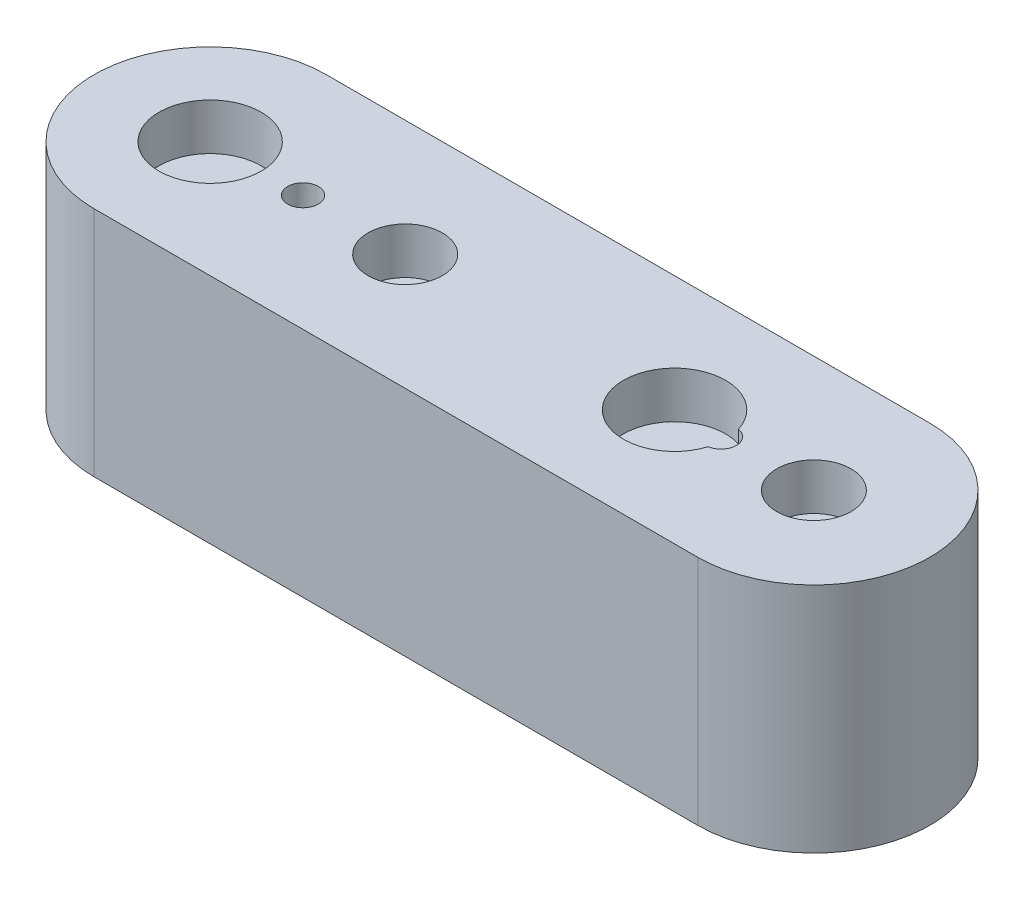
ISO-10303-21;
HEADER;
FILE_DESCRIPTION(('STEP AP214'),'2;1');
FILE_NAME('part.step','',(''),(''),'','','');
FILE_SCHEMA(('AUTOMOTIVE_DESIGN { 1 0 10303 214 1 1 1 1 }'));
ENDSEC;
DATA;
#1=APPLICATION_CONTEXT('core data for automotive mechanical design processes');
#2=APPLICATION_PROTOCOL_DEFINITION('international standard','automotive_design',2000,#1);
#3=PRODUCT_CONTEXT('',#1,'mechanical');
#4=PRODUCT('Part','Part','',(#3));
#5=PRODUCT_RELATED_PRODUCT_CATEGORY('part','',(#4));
#6=PRODUCT_DEFINITION_FORMATION('','',#4);
#7=PRODUCT_DEFINITION_CONTEXT('part definition',#1,'design');
#8=PRODUCT_DEFINITION('design','',#6,#7);
#9=PRODUCT_DEFINITION_SHAPE('','',#8);
#10=(LENGTH_UNIT() NAMED_UNIT(*) SI_UNIT(.MILLI.,.METRE.));
#11=(NAMED_UNIT(*) PLANE_ANGLE_UNIT() SI_UNIT($,.RADIAN.));
#12=(NAMED_UNIT(*) SI_UNIT($,.STERADIAN.) SOLID_ANGLE_UNIT());
#13=UNCERTAINTY_MEASURE_WITH_UNIT(LENGTH_MEASURE(1.E-05),#10,'distance_accuracy_value','');
#14=(GEOMETRIC_REPRESENTATION_CONTEXT(3) GLOBAL_UNCERTAINTY_ASSIGNED_CONTEXT((#13)) GLOBAL_UNIT_ASSIGNED_CONTEXT((#10,
#11,#12)) REPRESENTATION_CONTEXT('',''));
#15=CARTESIAN_POINT('',(0.,0.,0.));
#16=DIRECTION('',(0.,0.,1.));
#17=DIRECTION('',(1.,0.,0.));
#18=AXIS2_PLACEMENT_3D('',#15,#16,#17);
#19=CARTESIAN_POINT('',(-32.5,20.,0.));
#20=DIRECTION('',(0.,1.,0.));
#21=DIRECTION('',(1.,0.,0.));
#22=AXIS2_PLACEMENT_3D('',#19,#20,#21);
#23=PLANE('',#22);
#24=CARTESIAN_POINT('',(-32.5,20.,0.));
#25=DIRECTION('',(0.,1.,0.));
#26=DIRECTION('',(0.,0.,1.));
#27=AXIS2_PLACEMENT_3D('',#24,#25,#26);
#28=CIRCLE('',#27,5.5);
#29=CARTESIAN_POINT('',(-32.5,20.,5.5));
#30=VERTEX_POINT('',#29);
#31=EDGE_CURVE('E593',#30,#30,#28,.T.);
#32=ORIENTED_EDGE('',*,*,#31,.T.);
#33=EDGE_LOOP('',(#32));
#34=FACE_BOUND('',#33,.T.);
#35=ADVANCED_FACE('F17',(#34),#23,.T.);
#36=CARTESIAN_POINT('',(-11.5,20.,0.));
#37=DIRECTION('',(0.,1.,0.));
#38=DIRECTION('',(1.,0.,0.));
#39=AXIS2_PLACEMENT_3D('',#36,#37,#38);
#40=PLANE('',#39);
#41=CARTESIAN_POINT('',(-11.5,20.,0.));
#42=DIRECTION('',(0.,1.,0.));
#43=DIRECTION('',(0.,0.,1.));
#44=AXIS2_PLACEMENT_3D('',#41,#42,#43);
#45=CIRCLE('',#44,4.);
#46=CARTESIAN_POINT('',(-11.5,20.,4.));
#47=VERTEX_POINT('',#46);
#48=EDGE_CURVE('E552',#47,#47,#45,.T.);
#49=ORIENTED_EDGE('',*,*,#48,.T.);
#50=EDGE_LOOP('',(#49));
#51=FACE_BOUND('',#50,.T.);
#52=ADVANCED_FACE('F379',(#51),#40,.T.);
#53=CARTESIAN_POINT('',(32.5,20.,0.));
#54=DIRECTION('',(0.,1.,0.));
#55=DIRECTION('',(1.,0.,0.));
#56=AXIS2_PLACEMENT_3D('',#53,#54,#55);
#57=PLANE('',#56);
#58=CARTESIAN_POINT('',(32.5,20.,0.));
#59=DIRECTION('',(0.,1.,0.));
#60=DIRECTION('',(0.,0.,1.));
#61=AXIS2_PLACEMENT_3D('',#58,#59,#60);
#62=CIRCLE('',#61,4.);
#63=CARTESIAN_POINT('',(32.5,20.,3.99999999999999));
#64=VERTEX_POINT('',#63);
#65=EDGE_CURVE('E530',#64,#64,#62,.T.);
#66=ORIENTED_EDGE('',*,*,#65,.T.);
#67=EDGE_LOOP('',(#66));
#68=FACE_BOUND('',#67,.T.);
#69=ADVANCED_FACE('F370',(#68),#57,.T.);
#70=CARTESIAN_POINT('',(17.5,20.,0.));
#71=DIRECTION('',(0.,1.,0.));
#72=DIRECTION('',(1.,0.,0.));
#73=AXIS2_PLACEMENT_3D('',#70,#71,#72);
#74=PLANE('',#73);
#75=CARTESIAN_POINT('',(22.5,20.,0.));
#76=DIRECTION('',(0.,1.,0.));
#77=DIRECTION('',(0.,0.,1.));
#78=AXIS2_PLACEMENT_3D('',#75,#76,#77);
#79=CIRCLE('',#78,1.65);
#80=CARTESIAN_POINT('',(22.75275,20.,-1.63052673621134));
#81=VERTEX_POINT('',#80);
#82=CARTESIAN_POINT('',(22.75275,20.,1.63052673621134));
#83=VERTEX_POINT('',#82);
#84=EDGE_CURVE('E527',#81,#83,#79,.T.);
#85=ORIENTED_EDGE('',*,*,#84,.F.);
#86=CARTESIAN_POINT('',(17.5,20.,0.));
#87=DIRECTION('',(0.,1.,0.));
#88=DIRECTION('',(0.,0.,1.));
#89=AXIS2_PLACEMENT_3D('',#86,#87,#88);
#90=CIRCLE('',#89,5.5);
#91=EDGE_CURVE('E37',#81,#83,#90,.T.);
#92=ORIENTED_EDGE('',*,*,#91,.T.);
#93=EDGE_LOOP('',(#85,#92));
#94=FACE_BOUND('',#93,.T.);
#95=ADVANCED_FACE('F362',(#94),#74,.T.);
#96=CARTESIAN_POINT('',(-32.5,25.,-12.5));
#97=DIRECTION('',(0.,0.,1.));
#98=DIRECTION('',(1.,0.,0.));
#99=AXIS2_PLACEMENT_3D('',#96,#97,#98);
#100=PLANE('',#99);
#101=DIRECTION('',(-1.,0.,0.));
#102=VECTOR('',#101,1.);
#103=CARTESIAN_POINT('',(-32.5,0.,-12.5));
#104=LINE('',#103,#102);
#105=CARTESIAN_POINT('',(32.5,0.,-12.5));
#106=VERTEX_POINT('',#105);
#107=CARTESIAN_POINT('',(-32.5,0.,-12.5));
#108=VERTEX_POINT('',#107);
#109=EDGE_CURVE('E101',#106,#108,#104,.T.);
#110=ORIENTED_EDGE('',*,*,#109,.T.);
#111=DIRECTION('',(0.,-1.,0.));
#112=VECTOR('',#111,1.);
#113=CARTESIAN_POINT('',(-32.5,25.,-12.5));
#114=LINE('',#113,#112);
#115=CARTESIAN_POINT('',(-32.5,25.,-12.5));
#116=VERTEX_POINT('',#115);
#117=EDGE_CURVE('E87',#116,#108,#114,.T.);
#118=ORIENTED_EDGE('',*,*,#117,.F.);
#119=DIRECTION('',(-1.,0.,0.));
#120=VECTOR('',#119,1.);
#121=CARTESIAN_POINT('',(-32.5,25.,-12.5));
#122=LINE('',#121,#120);
#123=CARTESIAN_POINT('',(32.5,25.,-12.5));
#124=VERTEX_POINT('',#123);
#125=EDGE_CURVE('E111',#124,#116,#122,.T.);
#126=ORIENTED_EDGE('',*,*,#125,.F.);
#127=DIRECTION('',(0.,-1.,0.));
#128=VECTOR('',#127,1.);
#129=CARTESIAN_POINT('',(32.5,25.,-12.5));
#130=LINE('',#129,#128);
#131=EDGE_CURVE('E25',#124,#106,#130,.T.);
#132=ORIENTED_EDGE('',*,*,#131,.T.);
#133=EDGE_LOOP('',(#110,#118,#126,#132));
#134=FACE_BOUND('',#133,.T.);
#135=ADVANCED_FACE('F124',(#134),#100,.F.);
#136=CARTESIAN_POINT('',(32.5,25.,0.));
#137=DIRECTION('',(0.,-1.,0.));
#138=DIRECTION('',(0.,0.,-1.));
#139=AXIS2_PLACEMENT_3D('',#136,#137,#138);
#140=CYLINDRICAL_SURFACE('',#139,12.5);
#141=CARTESIAN_POINT('',(32.5,0.,0.));
#142=DIRECTION('',(0.,1.,0.));
#143=DIRECTION('',(0.,0.,1.));
#144=AXIS2_PLACEMENT_3D('',#141,#142,#143);
#145=CIRCLE('',#144,12.5);
#146=CARTESIAN_POINT('',(32.5,0.,12.5));
#147=VERTEX_POINT('',#146);
#148=EDGE_CURVE('E94',#147,#106,#145,.T.);
#149=ORIENTED_EDGE('',*,*,#148,.T.);
#150=ORIENTED_EDGE('',*,*,#131,.F.);
#151=CARTESIAN_POINT('',(32.5,25.,0.));
#152=DIRECTION('',(0.,1.,0.));
#153=DIRECTION('',(0.,0.,1.));
#154=AXIS2_PLACEMENT_3D('',#151,#152,#153);
#155=CIRCLE('',#154,12.5);
#156=CARTESIAN_POINT('',(32.5,25.,12.5));
#157=VERTEX_POINT('',#156);
#158=EDGE_CURVE('E137',#157,#124,#155,.T.);
#159=ORIENTED_EDGE('',*,*,#158,.F.);
#160=DIRECTION('',(0.,-1.,0.));
#161=VECTOR('',#160,1.);
#162=CARTESIAN_POINT('',(32.5,25.,12.5));
#163=LINE('',#162,#161);
#164=EDGE_CURVE('E51',#157,#147,#163,.T.);
#165=ORIENTED_EDGE('',*,*,#164,.T.);
#166=EDGE_LOOP('',(#149,#150,#159,#165));
#167=FACE_BOUND('',#166,.T.);
#168=ADVANCED_FACE('F127',(#167),#140,.T.);
#169=CARTESIAN_POINT('',(-32.5,25.,12.5));
#170=DIRECTION('',(0.,0.,-1.));
#171=DIRECTION('',(-1.,0.,0.));
#172=AXIS2_PLACEMENT_3D('',#169,#170,#171);
#173=PLANE('',#172);
#174=DIRECTION('',(1.,0.,0.));
#175=VECTOR('',#174,1.);
#176=CARTESIAN_POINT('',(-32.5,0.,12.5));
#177=LINE('',#176,#175);
#178=CARTESIAN_POINT('',(-32.5,0.,12.5));
#179=VERTEX_POINT('',#178);
#180=EDGE_CURVE('E78',#179,#147,#177,.T.);
#181=ORIENTED_EDGE('',*,*,#180,.T.);
#182=ORIENTED_EDGE('',*,*,#164,.F.);
#183=DIRECTION('',(1.,0.,0.));
#184=VECTOR('',#183,1.);
#185=CARTESIAN_POINT('',(-32.5,25.,12.5));
#186=LINE('',#185,#184);
#187=CARTESIAN_POINT('',(-32.5,25.,12.5));
#188=VERTEX_POINT('',#187);
#189=EDGE_CURVE('E81',#188,#157,#186,.T.);
#190=ORIENTED_EDGE('',*,*,#189,.F.);
#191=DIRECTION('',(0.,-1.,0.));
#192=VECTOR('',#191,1.);
#193=CARTESIAN_POINT('',(-32.5,25.,12.5));
#194=LINE('',#193,#192);
#195=EDGE_CURVE('E75',#188,#179,#194,.T.);
#196=ORIENTED_EDGE('',*,*,#195,.T.);
#197=EDGE_LOOP('',(#181,#182,#190,#196));
#198=FACE_BOUND('',#197,.T.);
#199=ADVANCED_FACE('F77',(#198),#173,.F.);
#200=CARTESIAN_POINT('',(-32.5,25.,0.));
#201=DIRECTION('',(0.,-1.,0.));
#202=DIRECTION('',(0.,0.,-1.));
#203=AXIS2_PLACEMENT_3D('',#200,#201,#202);
#204=CYLINDRICAL_SURFACE('',#203,12.5);
#205=CARTESIAN_POINT('',(-32.5,0.,0.));
#206=DIRECTION('',(0.,1.,0.));
#207=DIRECTION('',(0.,0.,1.));
#208=AXIS2_PLACEMENT_3D('',#205,#206,#207);
#209=CIRCLE('',#208,12.5);
#210=EDGE_CURVE('E93',#108,#179,#209,.T.);
#211=ORIENTED_EDGE('',*,*,#210,.T.);
#212=ORIENTED_EDGE('',*,*,#195,.F.);
#213=CARTESIAN_POINT('',(-32.5,25.,0.));
#214=DIRECTION('',(0.,1.,0.));
#215=DIRECTION('',(0.,0.,1.));
#216=AXIS2_PLACEMENT_3D('',#213,#214,#215);
#217=CIRCLE('',#216,12.5);
#218=EDGE_CURVE('E134',#116,#188,#217,.T.);
#219=ORIENTED_EDGE('',*,*,#218,.F.);
#220=ORIENTED_EDGE('',*,*,#117,.T.);
#221=EDGE_LOOP('',(#211,#212,#219,#220));
#222=FACE_BOUND('',#221,.T.);
#223=ADVANCED_FACE('F97',(#222),#204,.T.);
#224=CARTESIAN_POINT('',(-32.5,0.,0.));
#225=DIRECTION('',(0.,1.,0.));
#226=DIRECTION('',(1.,0.,0.));
#227=AXIS2_PLACEMENT_3D('',#224,#225,#226);
#228=PLANE('',#227);
#229=CARTESIAN_POINT('',(22.5,0.,0.));
#230=DIRECTION('',(0.,1.,0.));
#231=DIRECTION('',(0.,0.,1.));
#232=AXIS2_PLACEMENT_3D('',#229,#230,#231);
#233=CIRCLE('',#232,1.65);
#234=CARTESIAN_POINT('',(22.5,0.,1.65));
#235=VERTEX_POINT('',#234);
#236=EDGE_CURVE('E153',#235,#235,#233,.T.);
#237=ORIENTED_EDGE('',*,*,#236,.T.);
#238=EDGE_LOOP('',(#237));
#239=FACE_BOUND('',#238,.T.);
#240=CARTESIAN_POINT('',(-22.5,0.,0.));
#241=DIRECTION('',(0.,1.,0.));
#242=DIRECTION('',(0.,0.,1.));
#243=AXIS2_PLACEMENT_3D('',#240,#241,#242);
#244=CIRCLE('',#243,1.65);
#245=CARTESIAN_POINT('',(-22.5,0.,1.65));
#246=VERTEX_POINT('',#245);
#247=EDGE_CURVE('E152',#246,#246,#244,.T.);
#248=ORIENTED_EDGE('',*,*,#247,.T.);
#249=EDGE_LOOP('',(#248));
#250=FACE_BOUND('',#249,.T.);
#251=ORIENTED_EDGE('',*,*,#210,.F.);
#252=ORIENTED_EDGE('',*,*,#109,.F.);
#253=ORIENTED_EDGE('',*,*,#148,.F.);
#254=ORIENTED_EDGE('',*,*,#180,.F.);
#255=EDGE_LOOP('',(#251,#252,#253,#254));
#256=FACE_BOUND('',#255,.T.);
#257=ADVANCED_FACE('F91',(#239,#250,#256),#228,.F.);
#258=CARTESIAN_POINT('',(-32.5,25.,0.));
#259=DIRECTION('',(0.,1.,0.));
#260=DIRECTION('',(1.,0.,0.));
#261=AXIS2_PLACEMENT_3D('',#258,#259,#260);
#262=PLANE('',#261);
#263=CARTESIAN_POINT('',(-22.5,25.,0.));
#264=DIRECTION('',(0.,1.,0.));
#265=DIRECTION('',(0.,0.,1.));
#266=AXIS2_PLACEMENT_3D('',#263,#264,#265);
#267=CIRCLE('',#266,1.65);
#268=CARTESIAN_POINT('',(-22.5,25.,1.65));
#269=VERTEX_POINT('',#268);
#270=EDGE_CURVE('E149',#269,#269,#267,.T.);
#271=ORIENTED_EDGE('',*,*,#270,.F.);
#272=EDGE_LOOP('',(#271));
#273=FACE_BOUND('',#272,.T.);
#274=CARTESIAN_POINT('',(32.5,25.,0.));
#275=DIRECTION('',(0.,1.,0.));
#276=DIRECTION('',(0.,0.,1.));
#277=AXIS2_PLACEMENT_3D('',#274,#275,#276);
#278=CIRCLE('',#277,4.);
#279=CARTESIAN_POINT('',(32.5,25.,3.99999999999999));
#280=VERTEX_POINT('',#279);
#281=EDGE_CURVE('E519',#280,#280,#278,.T.);
#282=ORIENTED_EDGE('',*,*,#281,.F.);
#283=EDGE_LOOP('',(#282));
#284=FACE_BOUND('',#283,.T.);
#285=CARTESIAN_POINT('',(17.5,25.,0.));
#286=DIRECTION('',(0.,1.,0.));
#287=DIRECTION('',(0.,0.,1.));
#288=AXIS2_PLACEMENT_3D('',#285,#286,#287);
#289=CIRCLE('',#288,5.5);
#290=CARTESIAN_POINT('',(22.75275,25.,-1.63052673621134));
#291=VERTEX_POINT('',#290);
#292=CARTESIAN_POINT('',(22.75275,25.,1.63052673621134));
#293=VERTEX_POINT('',#292);
#294=EDGE_CURVE('E176',#291,#293,#289,.T.);
#295=ORIENTED_EDGE('',*,*,#294,.F.);
#296=CARTESIAN_POINT('',(22.5,25.,0.));
#297=DIRECTION('',(0.,1.,0.));
#298=DIRECTION('',(0.,0.,1.));
#299=AXIS2_PLACEMENT_3D('',#296,#297,#298);
#300=CIRCLE('',#299,1.65);
#301=EDGE_CURVE('E102',#293,#291,#300,.T.);
#302=ORIENTED_EDGE('',*,*,#301,.F.);
#303=EDGE_LOOP('',(#295,#302));
#304=FACE_BOUND('',#303,.T.);
#305=CARTESIAN_POINT('',(-11.5,25.,0.));
#306=DIRECTION('',(0.,1.,0.));
#307=DIRECTION('',(0.,0.,1.));
#308=AXIS2_PLACEMENT_3D('',#305,#306,#307);
#309=CIRCLE('',#308,4.);
#310=CARTESIAN_POINT('',(-11.5,25.,4.));
#311=VERTEX_POINT('',#310);
#312=EDGE_CURVE('E535',#311,#311,#309,.T.);
#313=ORIENTED_EDGE('',*,*,#312,.F.);
#314=EDGE_LOOP('',(#313));
#315=FACE_BOUND('',#314,.T.);
#316=CARTESIAN_POINT('',(-32.5,25.,0.));
#317=DIRECTION('',(0.,1.,0.));
#318=DIRECTION('',(0.,0.,1.));
#319=AXIS2_PLACEMENT_3D('',#316,#317,#318);
#320=CIRCLE('',#319,5.5);
#321=CARTESIAN_POINT('',(-32.5,25.,5.5));
#322=VERTEX_POINT('',#321);
#323=EDGE_CURVE('E569',#322,#322,#320,.T.);
#324=ORIENTED_EDGE('',*,*,#323,.F.);
#325=EDGE_LOOP('',(#324));
#326=FACE_BOUND('',#325,.T.);
#327=ORIENTED_EDGE('',*,*,#218,.T.);
#328=ORIENTED_EDGE('',*,*,#189,.T.);
#329=ORIENTED_EDGE('',*,*,#158,.T.);
#330=ORIENTED_EDGE('',*,*,#125,.T.);
#331=EDGE_LOOP('',(#327,#328,#329,#330));
#332=FACE_BOUND('',#331,.T.);
#333=ADVANCED_FACE('F164',(#273,#284,#304,#315,#326,#332),#262,.T.);
#334=CARTESIAN_POINT('',(-22.5,25.,0.));
#335=DIRECTION('',(0.,-1.,0.));
#336=DIRECTION('',(0.,0.,-1.));
#337=AXIS2_PLACEMENT_3D('',#334,#335,#336);
#338=CYLINDRICAL_SURFACE('',#337,1.65);
#339=ORIENTED_EDGE('',*,*,#247,.F.);
#340=EDGE_LOOP('',(#339));
#341=FACE_BOUND('',#340,.T.);
#342=ORIENTED_EDGE('',*,*,#270,.T.);
#343=EDGE_LOOP('',(#342));
#344=FACE_BOUND('',#343,.T.);
#345=ADVANCED_FACE('F238',(#341,#344),#338,.F.);
#346=CARTESIAN_POINT('',(22.5,25.,0.));
#347=DIRECTION('',(0.,-1.,0.));
#348=DIRECTION('',(0.,0.,-1.));
#349=AXIS2_PLACEMENT_3D('',#346,#347,#348);
#350=CYLINDRICAL_SURFACE('',#349,1.65);
#351=ORIENTED_EDGE('',*,*,#236,.F.);
#352=EDGE_LOOP('',(#351));
#353=FACE_BOUND('',#352,.T.);
#354=ORIENTED_EDGE('',*,*,#84,.T.);
#355=DIRECTION('',(0.,-1.,0.));
#356=VECTOR('',#355,1.);
#357=CARTESIAN_POINT('',(22.75275,22.5,1.63052673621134));
#358=LINE('',#357,#356);
#359=EDGE_CURVE('E523',#293,#83,#358,.T.);
#360=ORIENTED_EDGE('',*,*,#359,.F.);
#361=ORIENTED_EDGE('',*,*,#301,.T.);
#362=DIRECTION('',(0.,1.,0.));
#363=VECTOR('',#362,1.);
#364=CARTESIAN_POINT('',(22.75275,22.5,-1.63052673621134));
#365=LINE('',#364,#363);
#366=EDGE_CURVE('E11',#81,#291,#365,.T.);
#367=ORIENTED_EDGE('',*,*,#366,.F.);
#368=EDGE_LOOP('',(#354,#360,#361,#367));
#369=FACE_BOUND('',#368,.T.);
#370=ADVANCED_FACE('F244',(#353,#369),#350,.F.);
#371=CARTESIAN_POINT('',(17.5,20.,0.));
#372=DIRECTION('',(0.,1.,0.));
#373=DIRECTION('',(0.,0.,1.));
#374=AXIS2_PLACEMENT_3D('',#371,#372,#373);
#375=CYLINDRICAL_SURFACE('',#374,5.5);
#376=ORIENTED_EDGE('',*,*,#91,.F.);
#377=ORIENTED_EDGE('',*,*,#366,.T.);
#378=ORIENTED_EDGE('',*,*,#294,.T.);
#379=ORIENTED_EDGE('',*,*,#359,.T.);
#380=EDGE_LOOP('',(#376,#377,#378,#379));
#381=FACE_BOUND('',#380,.T.);
#382=ADVANCED_FACE('F259',(#381),#375,.F.);
#383=CARTESIAN_POINT('',(32.5,20.,0.));
#384=DIRECTION('',(0.,1.,0.));
#385=DIRECTION('',(0.,0.,1.));
#386=AXIS2_PLACEMENT_3D('',#383,#384,#385);
#387=CYLINDRICAL_SURFACE('',#386,4.);
#388=ORIENTED_EDGE('',*,*,#281,.T.);
#389=EDGE_LOOP('',(#388));
#390=FACE_BOUND('',#389,.T.);
#391=ORIENTED_EDGE('',*,*,#65,.F.);
#392=EDGE_LOOP('',(#391));
#393=FACE_BOUND('',#392,.T.);
#394=ADVANCED_FACE('F271',(#390,#393),#387,.F.);
#395=CARTESIAN_POINT('',(-11.5,20.,0.));
#396=DIRECTION('',(0.,1.,0.));
#397=DIRECTION('',(0.,0.,1.));
#398=AXIS2_PLACEMENT_3D('',#395,#396,#397);
#399=CYLINDRICAL_SURFACE('',#398,4.);
#400=ORIENTED_EDGE('',*,*,#312,.T.);
#401=EDGE_LOOP('',(#400));
#402=FACE_BOUND('',#401,.T.);
#403=ORIENTED_EDGE('',*,*,#48,.F.);
#404=EDGE_LOOP('',(#403));
#405=FACE_BOUND('',#404,.T.);
#406=ADVANCED_FACE('F284',(#402,#405),#399,.F.);
#407=CARTESIAN_POINT('',(-32.5,20.,0.));
#408=DIRECTION('',(0.,1.,0.));
#409=DIRECTION('',(0.,0.,1.));
#410=AXIS2_PLACEMENT_3D('',#407,#408,#409);
#411=CYLINDRICAL_SURFACE('',#410,5.5);
#412=ORIENTED_EDGE('',*,*,#323,.T.);
#413=EDGE_LOOP('',(#412));
#414=FACE_BOUND('',#413,.T.);
#415=ORIENTED_EDGE('',*,*,#31,.F.);
#416=EDGE_LOOP('',(#415));
#417=FACE_BOUND('',#416,.T.);
#418=ADVANCED_FACE('F295',(#414,#417),#411,.F.);
#419=CLOSED_SHELL('',(#35,#52,#69,#95,#135,#168,#199,#223,#257,#333,#345,#370,#382,#394,#406,#418));
#420=MANIFOLD_SOLID_BREP('B1',#419);
#421=ADVANCED_BREP_SHAPE_REPRESENTATION('',(#18,#420),#14);
#422=SHAPE_DEFINITION_REPRESENTATION(#9,#421);
ENDSEC;
END-ISO-10303-21;
